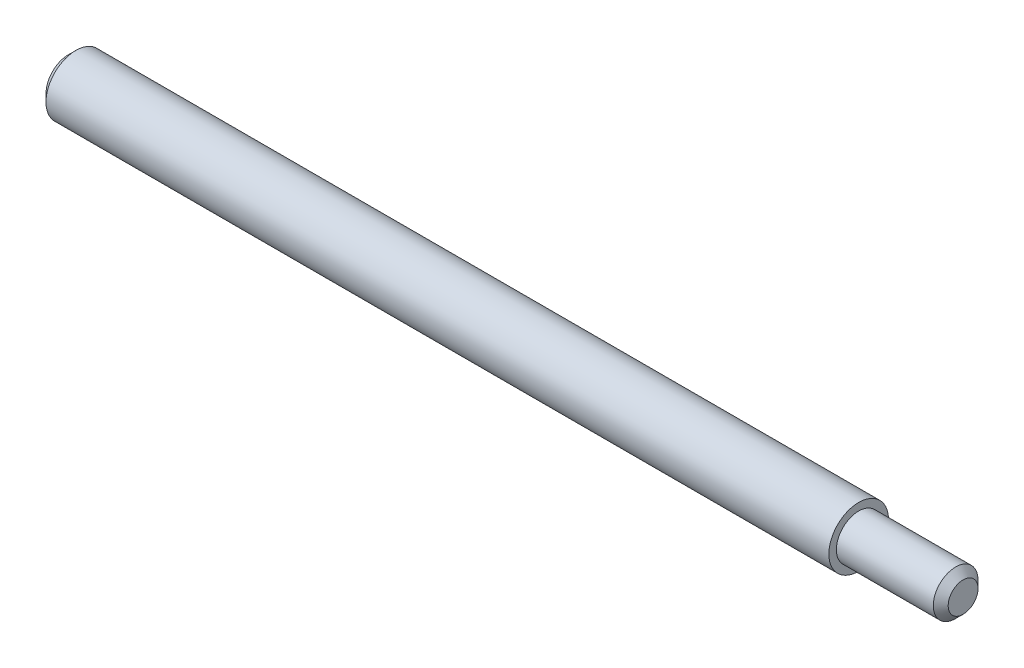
ISO-10303-21;
HEADER;
FILE_DESCRIPTION(('STEP AP214'),'2;1');
FILE_NAME('part.step','',(''),(''),'','','');
FILE_SCHEMA(('AUTOMOTIVE_DESIGN { 1 0 10303 214 1 1 1 1 }'));
ENDSEC;
DATA;
#1=APPLICATION_CONTEXT('core data for automotive mechanical design processes');
#2=APPLICATION_PROTOCOL_DEFINITION('international standard','automotive_design',2000,#1);
#3=PRODUCT_CONTEXT('',#1,'mechanical');
#4=PRODUCT('Part','Part','',(#3));
#5=PRODUCT_RELATED_PRODUCT_CATEGORY('part','',(#4));
#6=PRODUCT_DEFINITION_FORMATION('','',#4);
#7=PRODUCT_DEFINITION_CONTEXT('part definition',#1,'design');
#8=PRODUCT_DEFINITION('design','',#6,#7);
#9=PRODUCT_DEFINITION_SHAPE('','',#8);
#10=(LENGTH_UNIT() NAMED_UNIT(*) SI_UNIT(.MILLI.,.METRE.));
#11=(NAMED_UNIT(*) PLANE_ANGLE_UNIT() SI_UNIT($,.RADIAN.));
#12=(NAMED_UNIT(*) SI_UNIT($,.STERADIAN.) SOLID_ANGLE_UNIT());
#13=UNCERTAINTY_MEASURE_WITH_UNIT(LENGTH_MEASURE(1.E-05),#10,'distance_accuracy_value','');
#14=(GEOMETRIC_REPRESENTATION_CONTEXT(3) GLOBAL_UNCERTAINTY_ASSIGNED_CONTEXT((#13)) GLOBAL_UNIT_ASSIGNED_CONTEXT((#10,
#11,#12)) REPRESENTATION_CONTEXT('',''));
#15=CARTESIAN_POINT('',(0.,0.,0.));
#16=DIRECTION('',(0.,0.,1.));
#17=DIRECTION('',(1.,0.,0.));
#18=AXIS2_PLACEMENT_3D('',#15,#16,#17);
#19=CARTESIAN_POINT('',(0.,0.,0.));
#20=DIRECTION('',(1.,0.,0.));
#21=DIRECTION('',(0.,0.,-1.));
#22=AXIS2_PLACEMENT_3D('',#19,#20,#21);
#23=PLANE('',#22);
#24=CARTESIAN_POINT('',(0.,0.,0.));
#25=DIRECTION('',(1.,0.,0.));
#26=DIRECTION('',(0.,0.,-1.));
#27=AXIS2_PLACEMENT_3D('',#24,#25,#26);
#28=CIRCLE('',#27,2.99999999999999);
#29=CARTESIAN_POINT('',(0.,0.,-2.99999999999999));
#30=VERTEX_POINT('',#29);
#31=EDGE_CURVE('E39',#30,#30,#28,.F.);
#32=ORIENTED_EDGE('',*,*,#31,.T.);
#33=EDGE_LOOP('',(#32));
#34=FACE_BOUND('',#33,.T.);
#35=ADVANCED_FACE('F32',(#34),#23,.F.);
#36=CARTESIAN_POINT('',(120.000000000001,0.,0.));
#37=DIRECTION('',(-1.,0.,0.));
#38=DIRECTION('',(0.,0.,1.));
#39=AXIS2_PLACEMENT_3D('',#36,#37,#38);
#40=PLANE('',#39);
#41=CARTESIAN_POINT('',(120.000000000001,0.,0.));
#42=DIRECTION('',(-1.,0.,0.));
#43=DIRECTION('',(0.,0.,1.));
#44=AXIS2_PLACEMENT_3D('',#41,#42,#43);
#45=CIRCLE('',#44,2.);
#46=CARTESIAN_POINT('',(120.000000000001,0.,1.99999999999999));
#47=VERTEX_POINT('',#46);
#48=EDGE_CURVE('E43',#47,#47,#45,.T.);
#49=ORIENTED_EDGE('',*,*,#48,.F.);
#50=EDGE_LOOP('',(#49));
#51=FACE_BOUND('',#50,.T.);
#52=ADVANCED_FACE('F76',(#51),#40,.F.);
#53=CARTESIAN_POINT('',(120.000000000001,0.,0.));
#54=DIRECTION('',(-1.,0.,0.));
#55=DIRECTION('',(0.,0.,1.));
#56=AXIS2_PLACEMENT_3D('',#53,#54,#55);
#57=CONICAL_SURFACE('',#56,2.,0.785398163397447);
#58=CARTESIAN_POINT('',(119.,0.,0.));
#59=DIRECTION('',(-1.,0.,0.));
#60=DIRECTION('',(0.,0.,1.));
#61=AXIS2_PLACEMENT_3D('',#58,#59,#60);
#62=CIRCLE('',#61,3.);
#63=CARTESIAN_POINT('',(119.,0.,3.));
#64=VERTEX_POINT('',#63);
#65=EDGE_CURVE('E47',#64,#64,#62,.T.);
#66=ORIENTED_EDGE('',*,*,#65,.F.);
#67=EDGE_LOOP('',(#66));
#68=FACE_BOUND('',#67,.T.);
#69=ORIENTED_EDGE('',*,*,#48,.T.);
#70=EDGE_LOOP('',(#69));
#71=FACE_BOUND('',#70,.T.);
#72=ADVANCED_FACE('F70',(#68,#71),#57,.T.);
#73=CARTESIAN_POINT('',(-45.4747642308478,0.,0.));
#74=DIRECTION('',(-1.,0.,0.));
#75=DIRECTION('',(0.,0.,1.));
#76=AXIS2_PLACEMENT_3D('',#73,#74,#75);
#77=CYLINDRICAL_SURFACE('',#76,3.);
#78=CARTESIAN_POINT('',(106.000000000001,0.,-1.11022302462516E-13));
#79=DIRECTION('',(-1.,0.,0.));
#80=DIRECTION('',(0.,0.,1.));
#81=AXIS2_PLACEMENT_3D('',#78,#79,#80);
#82=CIRCLE('',#81,3.);
#83=CARTESIAN_POINT('',(106.000000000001,0.,2.99999999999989));
#84=VERTEX_POINT('',#83);
#85=EDGE_CURVE('E52',#84,#84,#82,.T.);
#86=ORIENTED_EDGE('',*,*,#85,.F.);
#87=EDGE_LOOP('',(#86));
#88=FACE_BOUND('',#87,.T.);
#89=ORIENTED_EDGE('',*,*,#65,.T.);
#90=EDGE_LOOP('',(#89));
#91=FACE_BOUND('',#90,.T.);
#92=ADVANCED_FACE('F64',(#88,#91),#77,.T.);
#93=CARTESIAN_POINT('',(106.000000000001,3.00000000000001,0.));
#94=DIRECTION('',(-1.,0.,0.));
#95=DIRECTION('',(0.,0.,1.));
#96=AXIS2_PLACEMENT_3D('',#93,#94,#95);
#97=PLANE('',#96);
#98=CARTESIAN_POINT('',(106.000000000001,0.,-1.11022302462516E-13));
#99=DIRECTION('',(-1.,0.,0.));
#100=DIRECTION('',(0.,0.,1.));
#101=AXIS2_PLACEMENT_3D('',#98,#99,#100);
#102=CIRCLE('',#101,4.);
#103=CARTESIAN_POINT('',(106.000000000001,0.,3.99999999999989));
#104=VERTEX_POINT('',#103);
#105=EDGE_CURVE('E55',#104,#104,#102,.T.);
#106=ORIENTED_EDGE('',*,*,#105,.F.);
#107=EDGE_LOOP('',(#106));
#108=FACE_BOUND('',#107,.T.);
#109=ORIENTED_EDGE('',*,*,#85,.T.);
#110=EDGE_LOOP('',(#109));
#111=FACE_BOUND('',#110,.T.);
#112=ADVANCED_FACE('F61',(#108,#111),#97,.F.);
#113=CARTESIAN_POINT('',(-45.4747642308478,0.,0.));
#114=DIRECTION('',(-1.,0.,0.));
#115=DIRECTION('',(0.,0.,1.));
#116=AXIS2_PLACEMENT_3D('',#113,#114,#115);
#117=CYLINDRICAL_SURFACE('',#116,4.);
#118=CARTESIAN_POINT('',(1.00000000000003,0.,0.));
#119=DIRECTION('',(1.,0.,0.));
#120=DIRECTION('',(0.,0.,-1.));
#121=AXIS2_PLACEMENT_3D('',#118,#119,#120);
#122=CIRCLE('',#121,4.);
#123=CARTESIAN_POINT('',(1.00000000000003,0.,-4.));
#124=VERTEX_POINT('',#123);
#125=EDGE_CURVE('E10',#124,#124,#122,.T.);
#126=ORIENTED_EDGE('',*,*,#125,.T.);
#127=EDGE_LOOP('',(#126));
#128=FACE_BOUND('',#127,.T.);
#129=ORIENTED_EDGE('',*,*,#105,.T.);
#130=EDGE_LOOP('',(#129));
#131=FACE_BOUND('',#130,.T.);
#132=ADVANCED_FACE('F59',(#128,#131),#117,.T.);
#133=CARTESIAN_POINT('',(0.,0.,0.));
#134=DIRECTION('',(1.,0.,0.));
#135=DIRECTION('',(0.,0.,-1.));
#136=AXIS2_PLACEMENT_3D('',#133,#134,#135);
#137=CONICAL_SURFACE('',#136,2.99999999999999,0.785398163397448);
#138=ORIENTED_EDGE('',*,*,#125,.F.);
#139=EDGE_LOOP('',(#138));
#140=FACE_BOUND('',#139,.T.);
#141=ORIENTED_EDGE('',*,*,#31,.F.);
#142=EDGE_LOOP('',(#141));
#143=FACE_BOUND('',#142,.T.);
#144=ADVANCED_FACE('F34',(#140,#143),#137,.T.);
#145=CLOSED_SHELL('',(#35,#52,#72,#92,#112,#132,#144));
#146=MANIFOLD_SOLID_BREP('B2',#145);
#147=ADVANCED_BREP_SHAPE_REPRESENTATION('',(#18,#146),#14);
#148=SHAPE_DEFINITION_REPRESENTATION(#9,#147);
ENDSEC;
END-ISO-10303-21;
